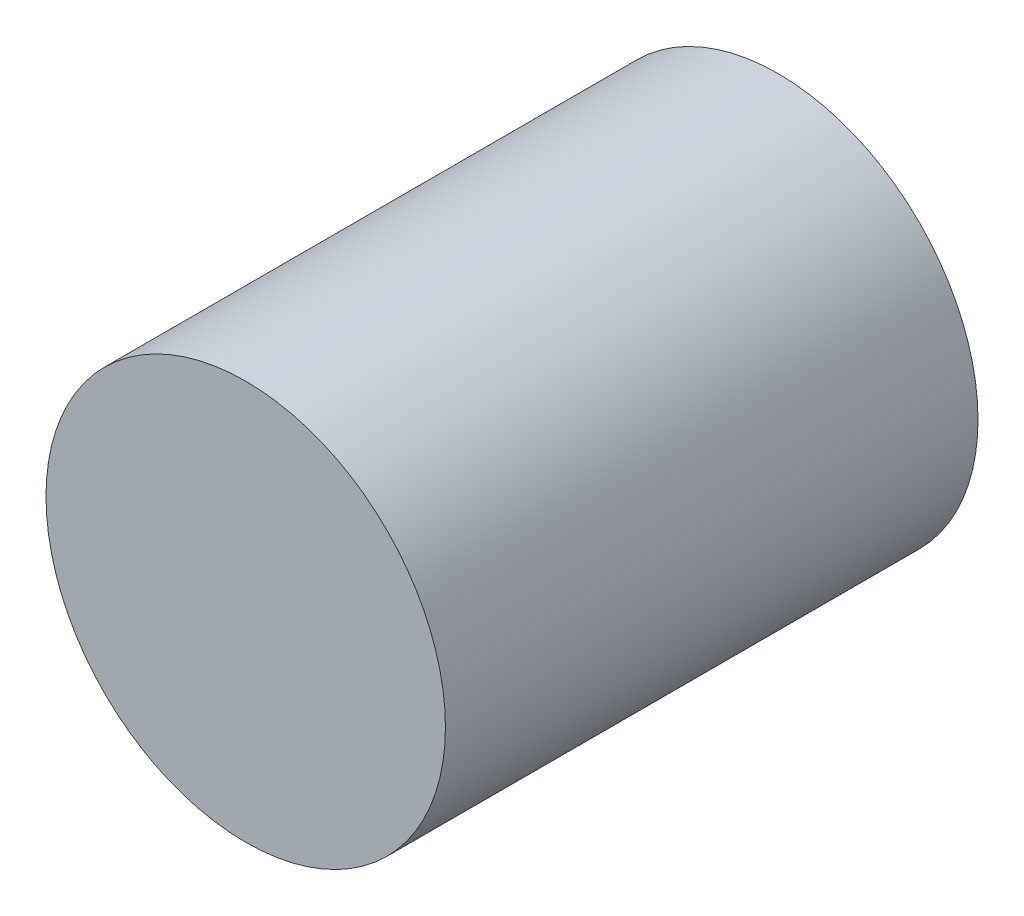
from build123d import *

# Parameters (mm, degrees)
SKETCH1_R      = 15
EXTRUDE1_DEPTH = 40


with BuildPart() as part:
    # Sketch1 → Extrude1 (new body)
    with BuildSketch(Plane.XY):
        Circle(SKETCH1_R)
    extrude(amount=-EXTRUDE1_DEPTH)


solid = part.part
